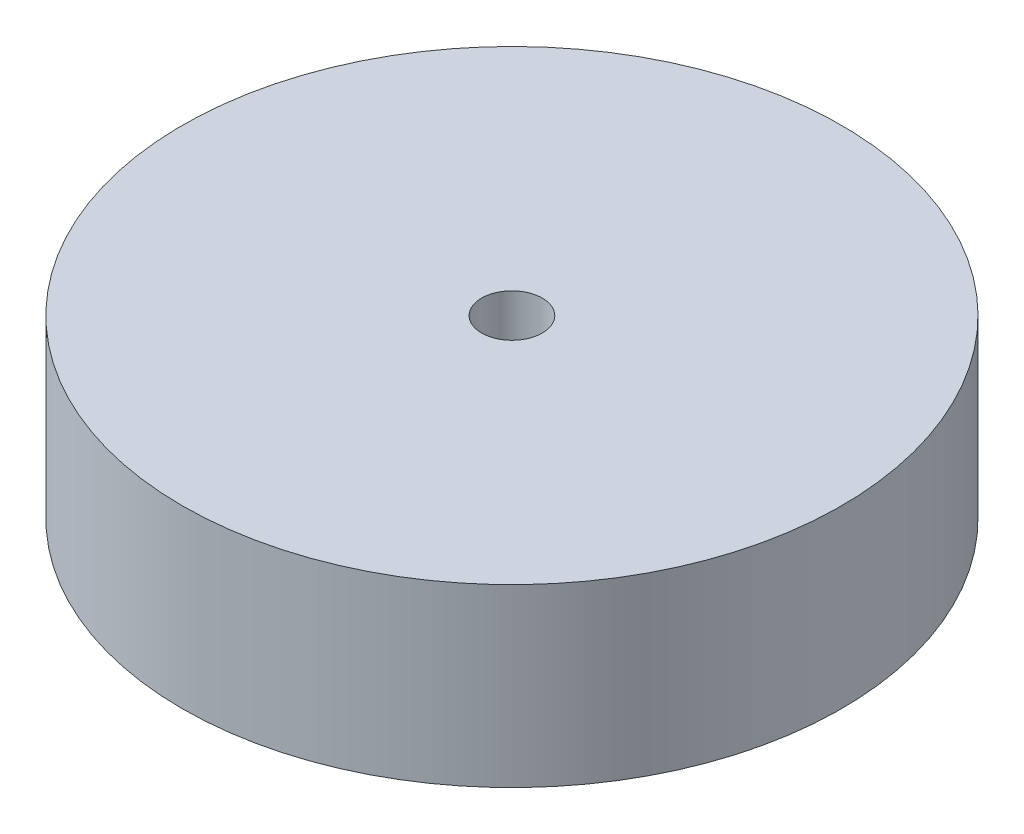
from build123d import *

# Parameters (mm, degrees)
SKETCH1_R                       = 19.05
EXTRUDE1_DEPTH                  = 10.16
F_6_32_TAPPED_HOLE2_D           = 2.7051
F_6_32_TAPPED_HOLE2_DEPTH       = 7.874
F_6_32_TAPPED_HOLE2_CBORE_D     = 3.5052
F_6_32_TAPPED_HOLE2_CBORE_DEPTH = 7.112
F_6_32_TAPPED_HOLE2_TIP         = 0.81269403


with BuildPart() as part:
    # Sketch1 → Extrude1 (new body)
    with BuildSketch(Plane(origin=(0, 0, 0), x_dir=(1, 0, 0), z_dir=(0, 1, 0))):
        with Locations(Location((0, 0, 0), (0, 0, 270))):
            Circle(SKETCH1_R)
    extrude(amount=EXTRUDE1_DEPTH)

    # 6-32 Tapped Hole2
    with Locations(Plane.ZX.offset(10.16)):
        with Locations((0, 0)):
            CounterBoreHole(F_6_32_TAPPED_HOLE2_D / 2, F_6_32_TAPPED_HOLE2_CBORE_D / 2, F_6_32_TAPPED_HOLE2_CBORE_DEPTH, depth=F_6_32_TAPPED_HOLE2_DEPTH)
            with Locations((0, 0, -(F_6_32_TAPPED_HOLE2_DEPTH + F_6_32_TAPPED_HOLE2_TIP / 2))):  # 118° drill point
                Cone(0, F_6_32_TAPPED_HOLE2_D / 2, F_6_32_TAPPED_HOLE2_TIP, mode=Mode.SUBTRACT)


solid = part.part
